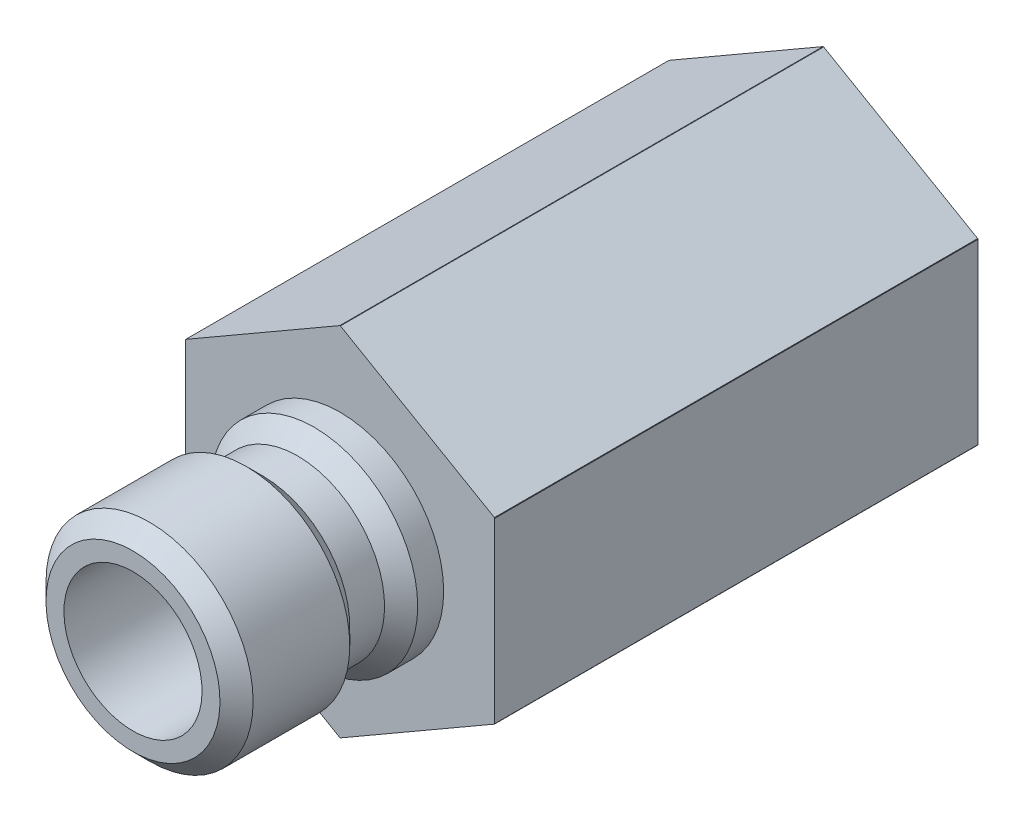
ISO-10303-21;
HEADER;
FILE_DESCRIPTION(('STEP AP214'),'2;1');
FILE_NAME('part.step','',(''),(''),'','','');
FILE_SCHEMA(('AUTOMOTIVE_DESIGN { 1 0 10303 214 1 1 1 1 }'));
ENDSEC;
DATA;
#1=APPLICATION_CONTEXT('core data for automotive mechanical design processes');
#2=APPLICATION_PROTOCOL_DEFINITION('international standard','automotive_design',2000,#1);
#3=PRODUCT_CONTEXT('',#1,'mechanical');
#4=PRODUCT('Part','Part','',(#3));
#5=PRODUCT_RELATED_PRODUCT_CATEGORY('part','',(#4));
#6=PRODUCT_DEFINITION_FORMATION('','',#4);
#7=PRODUCT_DEFINITION_CONTEXT('part definition',#1,'design');
#8=PRODUCT_DEFINITION('design','',#6,#7);
#9=PRODUCT_DEFINITION_SHAPE('','',#8);
#10=(LENGTH_UNIT() NAMED_UNIT(*) SI_UNIT(.MILLI.,.METRE.));
#11=(NAMED_UNIT(*) PLANE_ANGLE_UNIT() SI_UNIT($,.RADIAN.));
#12=(NAMED_UNIT(*) SI_UNIT($,.STERADIAN.) SOLID_ANGLE_UNIT());
#13=UNCERTAINTY_MEASURE_WITH_UNIT(LENGTH_MEASURE(1.E-05),#10,'distance_accuracy_value','');
#14=(GEOMETRIC_REPRESENTATION_CONTEXT(3) GLOBAL_UNCERTAINTY_ASSIGNED_CONTEXT((#13)) GLOBAL_UNIT_ASSIGNED_CONTEXT((#10,
#11,#12)) REPRESENTATION_CONTEXT('',''));
#15=CARTESIAN_POINT('',(0.,0.,0.));
#16=DIRECTION('',(0.,0.,1.));
#17=DIRECTION('',(1.,0.,0.));
#18=AXIS2_PLACEMENT_3D('',#15,#16,#17);
#19=CARTESIAN_POINT('',(0.,8.2042,-22.225));
#20=DIRECTION('',(0.,0.,-1.));
#21=DIRECTION('',(0.,1.,0.));
#22=AXIS2_PLACEMENT_3D('',#19,#20,#21);
#23=PLANE('',#22);
#24=CARTESIAN_POINT('',(0.,0.,-22.225));
#25=DIRECTION('',(0.,0.,-1.));
#26=DIRECTION('',(0.,1.,0.));
#27=AXIS2_PLACEMENT_3D('',#24,#25,#26);
#28=CIRCLE('',#27,5.93843847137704);
#29=CARTESIAN_POINT('',(0.,5.93843847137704,-22.225));
#30=VERTEX_POINT('',#29);
#31=EDGE_CURVE('E156',#30,#30,#28,.T.);
#32=ORIENTED_EDGE('',*,*,#31,.F.);
#33=EDGE_LOOP('',(#32));
#34=FACE_BOUND('',#33,.T.);
#35=CARTESIAN_POINT('',(0.,0.,-22.225));
#36=DIRECTION('',(0.,0.,-1.));
#37=DIRECTION('',(0.,1.,0.));
#38=AXIS2_PLACEMENT_3D('',#35,#36,#37);
#39=CIRCLE('',#38,8.2042);
#40=CARTESIAN_POINT('',(-7.112,4.09003100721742,-22.225));
#41=VERTEX_POINT('',#40);
#42=CARTESIAN_POINT('',(-7.09807075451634,4.11415716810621,-22.225));
#43=VERTEX_POINT('',#42);
#44=EDGE_CURVE('E137',#41,#43,#39,.T.);
#45=ORIENTED_EDGE('',*,*,#44,.T.);
#46=DIRECTION('',(-0.866025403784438,-0.5,0.));
#47=VECTOR('',#46,1.);
#48=CARTESIAN_POINT('',(0.,8.21223022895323,-22.225));
#49=LINE('',#48,#47);
#50=CARTESIAN_POINT('',(-0.0139292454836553,8.20418817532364,-22.225));
#51=VERTEX_POINT('',#50);
#52=EDGE_CURVE('E347',#51,#43,#49,.T.);
#53=ORIENTED_EDGE('',*,*,#52,.F.);
#54=CARTESIAN_POINT('',(0.0139292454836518,8.20418817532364,-22.225));
#55=VERTEX_POINT('',#54);
#56=EDGE_CURVE('E152',#51,#55,#39,.T.);
#57=ORIENTED_EDGE('',*,*,#56,.T.);
#58=DIRECTION('',(-0.866025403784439,0.5,0.));
#59=VECTOR('',#58,1.);
#60=CARTESIAN_POINT('',(7.112,4.10611511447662,-22.225));
#61=LINE('',#60,#59);
#62=CARTESIAN_POINT('',(7.09807075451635,4.11415716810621,-22.225));
#63=VERTEX_POINT('',#62);
#64=EDGE_CURVE('E306',#63,#55,#61,.T.);
#65=ORIENTED_EDGE('',*,*,#64,.F.);
#66=CARTESIAN_POINT('',(7.112,4.09003100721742,-22.225));
#67=VERTEX_POINT('',#66);
#68=EDGE_CURVE('E155',#63,#67,#39,.T.);
#69=ORIENTED_EDGE('',*,*,#68,.T.);
#70=DIRECTION('',(0.,1.,0.));
#71=VECTOR('',#70,1.);
#72=CARTESIAN_POINT('',(7.112,-4.10611511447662,-22.225));
#73=LINE('',#72,#71);
#74=CARTESIAN_POINT('',(7.112,-4.09003100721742,-22.225));
#75=VERTEX_POINT('',#74);
#76=EDGE_CURVE('E309',#75,#67,#73,.T.);
#77=ORIENTED_EDGE('',*,*,#76,.F.);
#78=CARTESIAN_POINT('',(7.09807075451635,-4.11415716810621,-22.225));
#79=VERTEX_POINT('',#78);
#80=EDGE_CURVE('E336',#75,#79,#39,.T.);
#81=ORIENTED_EDGE('',*,*,#80,.T.);
#82=DIRECTION('',(0.866025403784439,0.5,0.));
#83=VECTOR('',#82,1.);
#84=CARTESIAN_POINT('',(0.,-8.21223022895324,-22.225));
#85=LINE('',#84,#83);
#86=CARTESIAN_POINT('',(0.013929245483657,-8.20418817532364,-22.225));
#87=VERTEX_POINT('',#86);
#88=EDGE_CURVE('E312',#87,#79,#85,.T.);
#89=ORIENTED_EDGE('',*,*,#88,.F.);
#90=CARTESIAN_POINT('',(-0.0139292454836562,-8.20418817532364,-22.225));
#91=VERTEX_POINT('',#90);
#92=EDGE_CURVE('E338',#87,#91,#39,.T.);
#93=ORIENTED_EDGE('',*,*,#92,.T.);
#94=DIRECTION('',(0.866025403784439,-0.5,0.));
#95=VECTOR('',#94,1.);
#96=CARTESIAN_POINT('',(-7.112,-4.10611511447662,-22.225));
#97=LINE('',#96,#95);
#98=CARTESIAN_POINT('',(-7.09807075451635,-4.11415716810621,-22.225));
#99=VERTEX_POINT('',#98);
#100=EDGE_CURVE('E349',#99,#91,#97,.T.);
#101=ORIENTED_EDGE('',*,*,#100,.F.);
#102=CARTESIAN_POINT('',(-7.112,-4.09003100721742,-22.225));
#103=VERTEX_POINT('',#102);
#104=EDGE_CURVE('E342',#99,#103,#39,.T.);
#105=ORIENTED_EDGE('',*,*,#104,.T.);
#106=DIRECTION('',(0.,-1.,0.));
#107=VECTOR('',#106,1.);
#108=CARTESIAN_POINT('',(-7.112,4.10611511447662,-22.225));
#109=LINE('',#108,#107);
#110=EDGE_CURVE('E348',#41,#103,#109,.T.);
#111=ORIENTED_EDGE('',*,*,#110,.F.);
#112=EDGE_LOOP('',(#45,#53,#57,#65,#69,#77,#81,#89,#93,#101,#105,#111));
#113=FACE_BOUND('',#112,.T.);
#114=ADVANCED_FACE('F34',(#34,#113),#23,.T.);
#115=CARTESIAN_POINT('',(0.,0.,0.));
#116=DIRECTION('',(0.,0.,-1.));
#117=DIRECTION('',(0.,1.,0.));
#118=AXIS2_PLACEMENT_3D('',#115,#116,#117);
#119=CYLINDRICAL_SURFACE('',#118,8.2042);
#120=ORIENTED_EDGE('',*,*,#56,.F.);
#121=DIRECTION('',(0.,0.,-1.));
#122=VECTOR('',#121,1.);
#123=CARTESIAN_POINT('',(-0.0139292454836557,8.20418817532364,0.));
#124=LINE('',#123,#122);
#125=CARTESIAN_POINT('',(-0.0139292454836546,8.20418817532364,0.));
#126=VERTEX_POINT('',#125);
#127=EDGE_CURVE('E182',#51,#126,#124,.F.);
#128=ORIENTED_EDGE('',*,*,#127,.T.);
#129=CARTESIAN_POINT('',(0.,0.,0.));
#130=DIRECTION('',(0.,0.,-1.));
#131=DIRECTION('',(0.,1.,0.));
#132=AXIS2_PLACEMENT_3D('',#129,#130,#131);
#133=CIRCLE('',#132,8.2042);
#134=CARTESIAN_POINT('',(0.0139292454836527,8.20418817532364,0.));
#135=VERTEX_POINT('',#134);
#136=EDGE_CURVE('E143',#126,#135,#133,.T.);
#137=ORIENTED_EDGE('',*,*,#136,.T.);
#138=DIRECTION('',(0.,0.,-1.));
#139=VECTOR('',#138,1.);
#140=CARTESIAN_POINT('',(0.0139292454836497,8.20418817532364,0.));
#141=LINE('',#140,#139);
#142=EDGE_CURVE('E181',#135,#55,#141,.T.);
#143=ORIENTED_EDGE('',*,*,#142,.T.);
#144=EDGE_LOOP('',(#120,#128,#137,#143));
#145=FACE_BOUND('',#144,.T.);
#146=ADVANCED_FACE('F180',(#145),#119,.T.);
#147=CARTESIAN_POINT('',(-7.112,4.09003100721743,0.));
#148=VERTEX_POINT('',#147);
#149=CARTESIAN_POINT('',(-7.09807075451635,4.11415716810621,0.));
#150=VERTEX_POINT('',#149);
#151=EDGE_CURVE('E135',#148,#150,#133,.T.);
#152=ORIENTED_EDGE('',*,*,#151,.T.);
#153=DIRECTION('',(0.,0.,-1.));
#154=VECTOR('',#153,1.);
#155=CARTESIAN_POINT('',(-7.09807075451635,4.11415716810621,0.));
#156=LINE('',#155,#154);
#157=EDGE_CURVE('E49',#150,#43,#156,.T.);
#158=ORIENTED_EDGE('',*,*,#157,.T.);
#159=ORIENTED_EDGE('',*,*,#44,.F.);
#160=DIRECTION('',(0.,0.,-1.));
#161=VECTOR('',#160,1.);
#162=CARTESIAN_POINT('',(-7.112,4.09003100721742,0.));
#163=LINE('',#162,#161);
#164=EDGE_CURVE('E122',#41,#148,#163,.F.);
#165=ORIENTED_EDGE('',*,*,#164,.T.);
#166=EDGE_LOOP('',(#152,#158,#159,#165));
#167=FACE_BOUND('',#166,.T.);
#168=ADVANCED_FACE('F134',(#167),#119,.T.);
#169=ORIENTED_EDGE('',*,*,#68,.F.);
#170=DIRECTION('',(0.,0.,-1.));
#171=VECTOR('',#170,1.);
#172=CARTESIAN_POINT('',(7.09807075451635,4.11415716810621,0.));
#173=LINE('',#172,#171);
#174=CARTESIAN_POINT('',(7.09807075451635,4.11415716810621,0.));
#175=VERTEX_POINT('',#174);
#176=EDGE_CURVE('E189',#63,#175,#173,.F.);
#177=ORIENTED_EDGE('',*,*,#176,.T.);
#178=CARTESIAN_POINT('',(7.112,4.09003100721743,0.));
#179=VERTEX_POINT('',#178);
#180=EDGE_CURVE('E148',#175,#179,#133,.T.);
#181=ORIENTED_EDGE('',*,*,#180,.T.);
#182=DIRECTION('',(0.,0.,-1.));
#183=VECTOR('',#182,1.);
#184=CARTESIAN_POINT('',(7.112,4.09003100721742,0.));
#185=LINE('',#184,#183);
#186=EDGE_CURVE('E327',#179,#67,#185,.T.);
#187=ORIENTED_EDGE('',*,*,#186,.T.);
#188=EDGE_LOOP('',(#169,#177,#181,#187));
#189=FACE_BOUND('',#188,.T.);
#190=ADVANCED_FACE('F334',(#189),#119,.T.);
#191=ORIENTED_EDGE('',*,*,#80,.F.);
#192=DIRECTION('',(0.,0.,-1.));
#193=VECTOR('',#192,1.);
#194=CARTESIAN_POINT('',(7.112,-4.09003100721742,0.));
#195=LINE('',#194,#193);
#196=CARTESIAN_POINT('',(7.112,-4.09003100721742,0.));
#197=VERTEX_POINT('',#196);
#198=EDGE_CURVE('E330',#75,#197,#195,.F.);
#199=ORIENTED_EDGE('',*,*,#198,.T.);
#200=CARTESIAN_POINT('',(7.09807075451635,-4.11415716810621,0.));
#201=VERTEX_POINT('',#200);
#202=EDGE_CURVE('E357',#197,#201,#133,.T.);
#203=ORIENTED_EDGE('',*,*,#202,.T.);
#204=DIRECTION('',(0.,0.,-1.));
#205=VECTOR('',#204,1.);
#206=CARTESIAN_POINT('',(7.09807075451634,-4.11415716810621,0.));
#207=LINE('',#206,#205);
#208=EDGE_CURVE('E321',#201,#79,#207,.T.);
#209=ORIENTED_EDGE('',*,*,#208,.T.);
#210=EDGE_LOOP('',(#191,#199,#203,#209));
#211=FACE_BOUND('',#210,.T.);
#212=ADVANCED_FACE('F355',(#211),#119,.T.);
#213=ORIENTED_EDGE('',*,*,#92,.F.);
#214=DIRECTION('',(0.,0.,-1.));
#215=VECTOR('',#214,1.);
#216=CARTESIAN_POINT('',(0.0139292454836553,-8.20418817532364,0.));
#217=LINE('',#216,#215);
#218=CARTESIAN_POINT('',(0.0139292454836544,-8.20418817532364,0.));
#219=VERTEX_POINT('',#218);
#220=EDGE_CURVE('E324',#87,#219,#217,.F.);
#221=ORIENTED_EDGE('',*,*,#220,.T.);
#222=CARTESIAN_POINT('',(-0.0139292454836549,-8.20418817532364,0.));
#223=VERTEX_POINT('',#222);
#224=EDGE_CURVE('E145',#219,#223,#133,.T.);
#225=ORIENTED_EDGE('',*,*,#224,.T.);
#226=DIRECTION('',(0.,0.,-1.));
#227=VECTOR('',#226,1.);
#228=CARTESIAN_POINT('',(-0.0139292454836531,-8.20418817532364,0.));
#229=LINE('',#228,#227);
#230=EDGE_CURVE('E138',#223,#91,#229,.T.);
#231=ORIENTED_EDGE('',*,*,#230,.T.);
#232=EDGE_LOOP('',(#213,#221,#225,#231));
#233=FACE_BOUND('',#232,.T.);
#234=ADVANCED_FACE('F361',(#233),#119,.T.);
#235=ORIENTED_EDGE('',*,*,#104,.F.);
#236=DIRECTION('',(0.,0.,-1.));
#237=VECTOR('',#236,1.);
#238=CARTESIAN_POINT('',(-7.09807075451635,-4.11415716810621,0.));
#239=LINE('',#238,#237);
#240=CARTESIAN_POINT('',(-7.09807075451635,-4.11415716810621,0.));
#241=VERTEX_POINT('',#240);
#242=EDGE_CURVE('E318',#99,#241,#239,.F.);
#243=ORIENTED_EDGE('',*,*,#242,.T.);
#244=CARTESIAN_POINT('',(-7.112,-4.09003100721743,0.));
#245=VERTEX_POINT('',#244);
#246=EDGE_CURVE('E142',#241,#245,#133,.T.);
#247=ORIENTED_EDGE('',*,*,#246,.T.);
#248=DIRECTION('',(0.,0.,-1.));
#249=VECTOR('',#248,1.);
#250=CARTESIAN_POINT('',(-7.112,-4.09003100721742,0.));
#251=LINE('',#250,#249);
#252=EDGE_CURVE('E56',#245,#103,#251,.T.);
#253=ORIENTED_EDGE('',*,*,#252,.T.);
#254=EDGE_LOOP('',(#235,#243,#247,#253));
#255=FACE_BOUND('',#254,.T.);
#256=ADVANCED_FACE('F237',(#255),#119,.T.);
#257=CARTESIAN_POINT('',(0.,4.7625,0.));
#258=DIRECTION('',(0.,0.,1.));
#259=DIRECTION('',(0.,-1.,0.));
#260=AXIS2_PLACEMENT_3D('',#257,#258,#259);
#261=PLANE('',#260);
#262=CARTESIAN_POINT('',(0.,0.,0.));
#263=DIRECTION('',(0.,0.,-1.));
#264=DIRECTION('',(0.,1.,0.));
#265=AXIS2_PLACEMENT_3D('',#262,#263,#264);
#266=CIRCLE('',#265,4.7625);
#267=CARTESIAN_POINT('',(0.,4.7625,0.));
#268=VERTEX_POINT('',#267);
#269=EDGE_CURVE('E147',#268,#268,#266,.T.);
#270=ORIENTED_EDGE('',*,*,#269,.T.);
#271=EDGE_LOOP('',(#270));
#272=FACE_BOUND('',#271,.T.);
#273=ORIENTED_EDGE('',*,*,#136,.F.);
#274=DIRECTION('',(-0.866025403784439,-0.5,0.));
#275=VECTOR('',#274,1.);
#276=CARTESIAN_POINT('',(-1.49377700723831,7.34979767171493,0.));
#277=LINE('',#276,#275);
#278=EDGE_CURVE('E12',#126,#150,#277,.T.);
#279=ORIENTED_EDGE('',*,*,#278,.T.);
#280=ORIENTED_EDGE('',*,*,#151,.F.);
#281=DIRECTION('',(0.,-1.,0.));
#282=VECTOR('',#281,1.);
#283=CARTESIAN_POINT('',(-7.112,4.7625,0.));
#284=LINE('',#283,#282);
#285=EDGE_CURVE('E119',#148,#245,#284,.T.);
#286=ORIENTED_EDGE('',*,*,#285,.T.);
#287=ORIENTED_EDGE('',*,*,#246,.F.);
#288=DIRECTION('',(0.866025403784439,-0.5,0.));
#289=VECTOR('',#288,1.);
#290=CARTESIAN_POINT('',(-5.61822299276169,-4.96854767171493,0.));
#291=LINE('',#290,#289);
#292=EDGE_CURVE('E128',#241,#223,#291,.T.);
#293=ORIENTED_EDGE('',*,*,#292,.T.);
#294=ORIENTED_EDGE('',*,*,#224,.F.);
#295=DIRECTION('',(0.866025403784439,0.5,0.));
#296=VECTOR('',#295,1.);
#297=CARTESIAN_POINT('',(5.61822299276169,-4.96854767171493,0.));
#298=LINE('',#297,#296);
#299=EDGE_CURVE('E166',#219,#201,#298,.T.);
#300=ORIENTED_EDGE('',*,*,#299,.T.);
#301=ORIENTED_EDGE('',*,*,#202,.F.);
#302=DIRECTION('',(0.,1.,0.));
#303=VECTOR('',#302,1.);
#304=CARTESIAN_POINT('',(7.112,4.7625,0.));
#305=LINE('',#304,#303);
#306=EDGE_CURVE('E169',#197,#179,#305,.T.);
#307=ORIENTED_EDGE('',*,*,#306,.T.);
#308=ORIENTED_EDGE('',*,*,#180,.F.);
#309=DIRECTION('',(-0.866025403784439,0.5,0.));
#310=VECTOR('',#309,1.);
#311=CARTESIAN_POINT('',(1.49377700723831,7.34979767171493,0.));
#312=LINE('',#311,#310);
#313=EDGE_CURVE('E42',#175,#135,#312,.T.);
#314=ORIENTED_EDGE('',*,*,#313,.T.);
#315=EDGE_LOOP('',(#273,#279,#280,#286,#287,#293,#294,#300,#301,#307,#308,#314));
#316=FACE_BOUND('',#315,.T.);
#317=ADVANCED_FACE('F141',(#272,#316),#261,.T.);
#318=CARTESIAN_POINT('',(0.,0.,0.));
#319=DIRECTION('',(0.,0.,-1.));
#320=DIRECTION('',(0.,1.,0.));
#321=AXIS2_PLACEMENT_3D('',#318,#319,#320);
#322=CYLINDRICAL_SURFACE('',#321,3.175);
#323=CARTESIAN_POINT('',(0.,0.,-10.6045));
#324=DIRECTION('',(0.,0.,-1.));
#325=DIRECTION('',(0.,1.,0.));
#326=AXIS2_PLACEMENT_3D('',#323,#324,#325);
#327=CIRCLE('',#326,3.175);
#328=CARTESIAN_POINT('',(0.,3.175,-10.6045));
#329=VERTEX_POINT('',#328);
#330=EDGE_CURVE('E129',#329,#329,#327,.T.);
#331=ORIENTED_EDGE('',*,*,#330,.T.);
#332=EDGE_LOOP('',(#331));
#333=FACE_BOUND('',#332,.T.);
#334=CARTESIAN_POINT('',(0.,0.,9.525));
#335=DIRECTION('',(0.,0.,-1.));
#336=DIRECTION('',(0.,1.,0.));
#337=AXIS2_PLACEMENT_3D('',#334,#335,#336);
#338=CIRCLE('',#337,3.175);
#339=CARTESIAN_POINT('',(0.,3.175,9.525));
#340=VERTEX_POINT('',#339);
#341=EDGE_CURVE('E184',#340,#340,#338,.T.);
#342=ORIENTED_EDGE('',*,*,#341,.F.);
#343=EDGE_LOOP('',(#342));
#344=FACE_BOUND('',#343,.T.);
#345=ADVANCED_FACE('F36',(#333,#344),#322,.F.);
#346=CARTESIAN_POINT('',(0.,3.175,-10.6045));
#347=DIRECTION('',(0.,0.,-1.));
#348=DIRECTION('',(0.,1.,0.));
#349=AXIS2_PLACEMENT_3D('',#346,#347,#348);
#350=PLANE('',#349);
#351=CARTESIAN_POINT('',(0.,0.,-10.6045));
#352=DIRECTION('',(0.,0.,-1.));
#353=DIRECTION('',(0.,1.,0.));
#354=AXIS2_PLACEMENT_3D('',#351,#352,#353);
#355=CIRCLE('',#354,5.5753);
#356=CARTESIAN_POINT('',(0.,5.5753,-10.6045));
#357=VERTEX_POINT('',#356);
#358=EDGE_CURVE('E159',#357,#357,#355,.T.);
#359=ORIENTED_EDGE('',*,*,#358,.T.);
#360=EDGE_LOOP('',(#359));
#361=FACE_BOUND('',#360,.T.);
#362=ORIENTED_EDGE('',*,*,#330,.F.);
#363=EDGE_LOOP('',(#362));
#364=FACE_BOUND('',#363,.T.);
#365=ADVANCED_FACE('F226',(#361,#364),#350,.T.);
#366=CARTESIAN_POINT('',(0.,0.,-10.6045));
#367=DIRECTION('',(0.,0.,-1.));
#368=DIRECTION('',(0.,1.,0.));
#369=AXIS2_PLACEMENT_3D('',#366,#367,#368);
#370=CONICAL_SURFACE('',#369,5.5753,0.0312396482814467);
#371=ORIENTED_EDGE('',*,*,#31,.T.);
#372=EDGE_LOOP('',(#371));
#373=FACE_BOUND('',#372,.T.);
#374=ORIENTED_EDGE('',*,*,#358,.F.);
#375=EDGE_LOOP('',(#374));
#376=FACE_BOUND('',#375,.T.);
#377=ADVANCED_FACE('F217',(#373,#376),#370,.F.);
#378=CARTESIAN_POINT('',(0.,0.,0.));
#379=DIRECTION('',(0.,0.,-1.));
#380=DIRECTION('',(0.,1.,0.));
#381=AXIS2_PLACEMENT_3D('',#378,#379,#380);
#382=CYLINDRICAL_SURFACE('',#381,4.7625);
#383=CARTESIAN_POINT('',(0.,0.,1.1938));
#384=DIRECTION('',(0.,0.,-1.));
#385=DIRECTION('',(0.,1.,0.));
#386=AXIS2_PLACEMENT_3D('',#383,#384,#385);
#387=CIRCLE('',#386,4.7625);
#388=CARTESIAN_POINT('',(0.,4.7625,1.1938));
#389=VERTEX_POINT('',#388);
#390=EDGE_CURVE('E206',#389,#389,#387,.T.);
#391=ORIENTED_EDGE('',*,*,#390,.T.);
#392=EDGE_LOOP('',(#391));
#393=FACE_BOUND('',#392,.T.);
#394=ORIENTED_EDGE('',*,*,#269,.F.);
#395=EDGE_LOOP('',(#394));
#396=FACE_BOUND('',#395,.T.);
#397=ADVANCED_FACE('F214',(#393,#396),#382,.T.);
#398=CARTESIAN_POINT('',(0.,0.,1.1938));
#399=DIRECTION('',(0.,0.,-1.));
#400=DIRECTION('',(0.,1.,0.));
#401=AXIS2_PLACEMENT_3D('',#398,#399,#400);
#402=CONICAL_SURFACE('',#401,4.7625,0.785398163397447);
#403=CARTESIAN_POINT('',(0.,0.,1.9558));
#404=DIRECTION('',(0.,0.,-1.));
#405=DIRECTION('',(0.,1.,0.));
#406=AXIS2_PLACEMENT_3D('',#403,#404,#405);
#407=CIRCLE('',#406,4.0005);
#408=CARTESIAN_POINT('',(0.,4.0005,1.9558));
#409=VERTEX_POINT('',#408);
#410=EDGE_CURVE('E204',#409,#409,#407,.T.);
#411=ORIENTED_EDGE('',*,*,#410,.T.);
#412=EDGE_LOOP('',(#411));
#413=FACE_BOUND('',#412,.T.);
#414=ORIENTED_EDGE('',*,*,#390,.F.);
#415=EDGE_LOOP('',(#414));
#416=FACE_BOUND('',#415,.T.);
#417=ADVANCED_FACE('F216',(#413,#416),#402,.T.);
#418=CARTESIAN_POINT('',(0.,0.,0.));
#419=DIRECTION('',(0.,0.,-1.));
#420=DIRECTION('',(0.,1.,0.));
#421=AXIS2_PLACEMENT_3D('',#418,#419,#420);
#422=CYLINDRICAL_SURFACE('',#421,4.0005);
#423=CARTESIAN_POINT('',(0.,0.,3.556));
#424=DIRECTION('',(0.,0.,-1.));
#425=DIRECTION('',(0.,1.,0.));
#426=AXIS2_PLACEMENT_3D('',#423,#424,#425);
#427=CIRCLE('',#426,4.0005);
#428=CARTESIAN_POINT('',(0.,4.0005,3.556));
#429=VERTEX_POINT('',#428);
#430=EDGE_CURVE('E201',#429,#429,#427,.T.);
#431=ORIENTED_EDGE('',*,*,#430,.T.);
#432=EDGE_LOOP('',(#431));
#433=FACE_BOUND('',#432,.T.);
#434=ORIENTED_EDGE('',*,*,#410,.F.);
#435=EDGE_LOOP('',(#434));
#436=FACE_BOUND('',#435,.T.);
#437=ADVANCED_FACE('F223',(#433,#436),#422,.T.);
#438=CARTESIAN_POINT('',(0.,0.,3.556));
#439=DIRECTION('',(0.,0.,1.));
#440=DIRECTION('',(0.,-1.,0.));
#441=AXIS2_PLACEMENT_3D('',#438,#439,#440);
#442=CONICAL_SURFACE('',#441,4.0005,0.785398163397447);
#443=CARTESIAN_POINT('',(0.,0.,4.318));
#444=DIRECTION('',(0.,0.,-1.));
#445=DIRECTION('',(0.,1.,0.));
#446=AXIS2_PLACEMENT_3D('',#443,#444,#445);
#447=CIRCLE('',#446,4.7625);
#448=CARTESIAN_POINT('',(0.,4.7625,4.318));
#449=VERTEX_POINT('',#448);
#450=EDGE_CURVE('E198',#449,#449,#447,.T.);
#451=ORIENTED_EDGE('',*,*,#450,.T.);
#452=EDGE_LOOP('',(#451));
#453=FACE_BOUND('',#452,.T.);
#454=ORIENTED_EDGE('',*,*,#430,.F.);
#455=EDGE_LOOP('',(#454));
#456=FACE_BOUND('',#455,.T.);
#457=ADVANCED_FACE('F267',(#453,#456),#442,.T.);
#458=CARTESIAN_POINT('',(0.,0.,0.));
#459=DIRECTION('',(0.,0.,-1.));
#460=DIRECTION('',(0.,1.,0.));
#461=AXIS2_PLACEMENT_3D('',#458,#459,#460);
#462=CYLINDRICAL_SURFACE('',#461,4.7625);
#463=CARTESIAN_POINT('',(0.,0.,8.763));
#464=DIRECTION('',(0.,0.,-1.));
#465=DIRECTION('',(0.,1.,0.));
#466=AXIS2_PLACEMENT_3D('',#463,#464,#465);
#467=CIRCLE('',#466,4.7625);
#468=CARTESIAN_POINT('',(0.,4.7625,8.763));
#469=VERTEX_POINT('',#468);
#470=EDGE_CURVE('E195',#469,#469,#467,.T.);
#471=ORIENTED_EDGE('',*,*,#470,.T.);
#472=EDGE_LOOP('',(#471));
#473=FACE_BOUND('',#472,.T.);
#474=ORIENTED_EDGE('',*,*,#450,.F.);
#475=EDGE_LOOP('',(#474));
#476=FACE_BOUND('',#475,.T.);
#477=ADVANCED_FACE('F261',(#473,#476),#462,.T.);
#478=CARTESIAN_POINT('',(0.,0.,8.763));
#479=DIRECTION('',(0.,0.,-1.));
#480=DIRECTION('',(0.,1.,0.));
#481=AXIS2_PLACEMENT_3D('',#478,#479,#480);
#482=CONICAL_SURFACE('',#481,4.7625,0.785398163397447);
#483=CARTESIAN_POINT('',(0.,0.,9.525));
#484=DIRECTION('',(0.,0.,-1.));
#485=DIRECTION('',(0.,1.,0.));
#486=AXIS2_PLACEMENT_3D('',#483,#484,#485);
#487=CIRCLE('',#486,4.0005);
#488=CARTESIAN_POINT('',(0.,4.0005,9.525));
#489=VERTEX_POINT('',#488);
#490=EDGE_CURVE('E187',#489,#489,#487,.T.);
#491=ORIENTED_EDGE('',*,*,#490,.T.);
#492=EDGE_LOOP('',(#491));
#493=FACE_BOUND('',#492,.T.);
#494=ORIENTED_EDGE('',*,*,#470,.F.);
#495=EDGE_LOOP('',(#494));
#496=FACE_BOUND('',#495,.T.);
#497=ADVANCED_FACE('F255',(#493,#496),#482,.T.);
#498=CARTESIAN_POINT('',(0.,3.175,9.525));
#499=DIRECTION('',(0.,0.,1.));
#500=DIRECTION('',(0.,-1.,0.));
#501=AXIS2_PLACEMENT_3D('',#498,#499,#500);
#502=PLANE('',#501);
#503=ORIENTED_EDGE('',*,*,#341,.T.);
#504=EDGE_LOOP('',(#503));
#505=FACE_BOUND('',#504,.T.);
#506=ORIENTED_EDGE('',*,*,#490,.F.);
#507=EDGE_LOOP('',(#506));
#508=FACE_BOUND('',#507,.T.);
#509=ADVANCED_FACE('F252',(#505,#508),#502,.T.);
#510=CARTESIAN_POINT('',(-7.112,4.10611511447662,-22.225));
#511=DIRECTION('',(-1.,0.,0.));
#512=DIRECTION('',(0.,0.,1.));
#513=AXIS2_PLACEMENT_3D('',#510,#511,#512);
#514=PLANE('',#513);
#515=ORIENTED_EDGE('',*,*,#110,.T.);
#516=ORIENTED_EDGE('',*,*,#252,.F.);
#517=ORIENTED_EDGE('',*,*,#285,.F.);
#518=ORIENTED_EDGE('',*,*,#164,.F.);
#519=EDGE_LOOP('',(#515,#516,#517,#518));
#520=FACE_BOUND('',#519,.T.);
#521=ADVANCED_FACE('F121',(#520),#514,.T.);
#522=CARTESIAN_POINT('',(-7.112,-4.10611511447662,-22.225));
#523=DIRECTION('',(-0.5,-0.866025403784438,0.));
#524=DIRECTION('',(0.866025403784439,-0.5,0.));
#525=AXIS2_PLACEMENT_3D('',#522,#523,#524);
#526=PLANE('',#525);
#527=ORIENTED_EDGE('',*,*,#100,.T.);
#528=ORIENTED_EDGE('',*,*,#230,.F.);
#529=ORIENTED_EDGE('',*,*,#292,.F.);
#530=ORIENTED_EDGE('',*,*,#242,.F.);
#531=EDGE_LOOP('',(#527,#528,#529,#530));
#532=FACE_BOUND('',#531,.T.);
#533=ADVANCED_FACE('F290',(#532),#526,.T.);
#534=CARTESIAN_POINT('',(0.,-8.21223022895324,-22.225));
#535=DIRECTION('',(0.5,-0.866025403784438,0.));
#536=DIRECTION('',(0.866025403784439,0.5,0.));
#537=AXIS2_PLACEMENT_3D('',#534,#535,#536);
#538=PLANE('',#537);
#539=ORIENTED_EDGE('',*,*,#88,.T.);
#540=ORIENTED_EDGE('',*,*,#208,.F.);
#541=ORIENTED_EDGE('',*,*,#299,.F.);
#542=ORIENTED_EDGE('',*,*,#220,.F.);
#543=EDGE_LOOP('',(#539,#540,#541,#542));
#544=FACE_BOUND('',#543,.T.);
#545=ADVANCED_FACE('F293',(#544),#538,.T.);
#546=CARTESIAN_POINT('',(7.112,-4.10611511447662,-22.225));
#547=DIRECTION('',(1.,0.,0.));
#548=DIRECTION('',(0.,1.,0.));
#549=AXIS2_PLACEMENT_3D('',#546,#547,#548);
#550=PLANE('',#549);
#551=ORIENTED_EDGE('',*,*,#76,.T.);
#552=ORIENTED_EDGE('',*,*,#186,.F.);
#553=ORIENTED_EDGE('',*,*,#306,.F.);
#554=ORIENTED_EDGE('',*,*,#198,.F.);
#555=EDGE_LOOP('',(#551,#552,#553,#554));
#556=FACE_BOUND('',#555,.T.);
#557=ADVANCED_FACE('F297',(#556),#550,.T.);
#558=CARTESIAN_POINT('',(7.112,4.10611511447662,-22.225));
#559=DIRECTION('',(0.5,0.866025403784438,0.));
#560=DIRECTION('',(-0.866025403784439,0.5,0.));
#561=AXIS2_PLACEMENT_3D('',#558,#559,#560);
#562=PLANE('',#561);
#563=ORIENTED_EDGE('',*,*,#64,.T.);
#564=ORIENTED_EDGE('',*,*,#142,.F.);
#565=ORIENTED_EDGE('',*,*,#313,.F.);
#566=ORIENTED_EDGE('',*,*,#176,.F.);
#567=EDGE_LOOP('',(#563,#564,#565,#566));
#568=FACE_BOUND('',#567,.T.);
#569=ADVANCED_FACE('F287',(#568),#562,.T.);
#570=CARTESIAN_POINT('',(0.,8.21223022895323,-22.225));
#571=DIRECTION('',(-0.5,0.866025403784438,0.));
#572=DIRECTION('',(-0.866025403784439,-0.5,0.));
#573=AXIS2_PLACEMENT_3D('',#570,#571,#572);
#574=PLANE('',#573);
#575=ORIENTED_EDGE('',*,*,#52,.T.);
#576=ORIENTED_EDGE('',*,*,#157,.F.);
#577=ORIENTED_EDGE('',*,*,#278,.F.);
#578=ORIENTED_EDGE('',*,*,#127,.F.);
#579=EDGE_LOOP('',(#575,#576,#577,#578));
#580=FACE_BOUND('',#579,.T.);
#581=ADVANCED_FACE('F284',(#580),#574,.T.);
#582=CLOSED_SHELL('',(#114,#146,#168,#190,#212,#234,#256,#317,#345,#365,#377,#397,#417,#437,
#457,#477,#497,#509,#521,#533,#545,#557,#569,#581));
#583=MANIFOLD_SOLID_BREP('B2',#582);
#584=ADVANCED_BREP_SHAPE_REPRESENTATION('',(#18,#583),#14);
#585=SHAPE_DEFINITION_REPRESENTATION(#9,#584);
ENDSEC;
END-ISO-10303-21;
